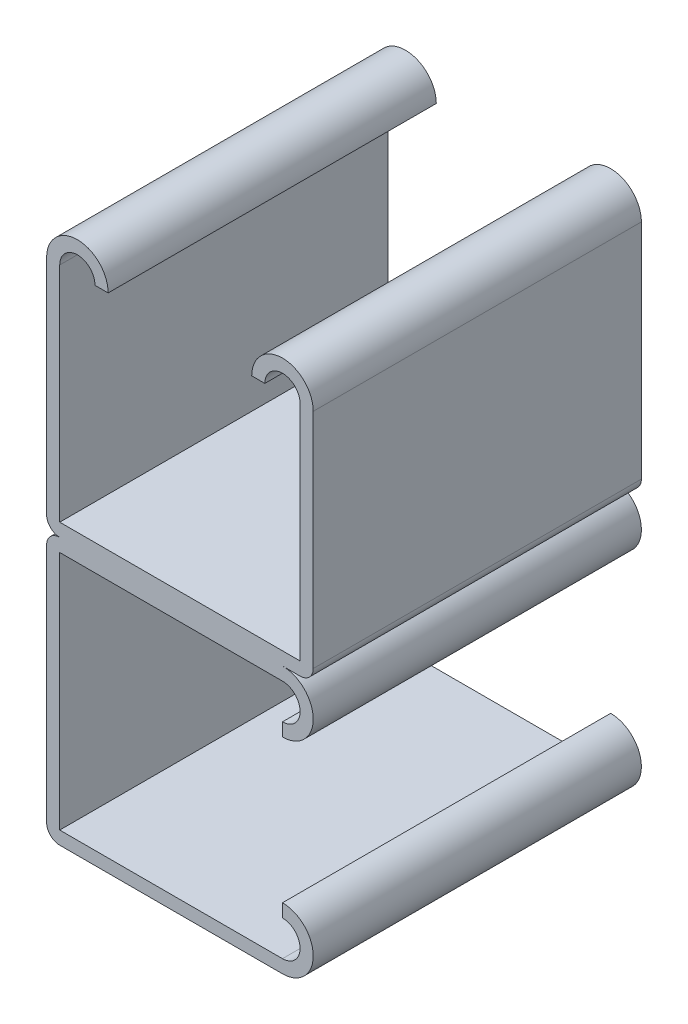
ISO-10303-21;
HEADER;
FILE_DESCRIPTION(('STEP AP214'),'2;1');
FILE_NAME('part.step','',(''),(''),'','','');
FILE_SCHEMA(('AUTOMOTIVE_DESIGN { 1 0 10303 214 1 1 1 1 }'));
ENDSEC;
DATA;
#1=APPLICATION_CONTEXT('core data for automotive mechanical design processes');
#2=APPLICATION_PROTOCOL_DEFINITION('international standard','automotive_design',2000,#1);
#3=PRODUCT_CONTEXT('',#1,'mechanical');
#4=PRODUCT('Part','Part','',(#3));
#5=PRODUCT_RELATED_PRODUCT_CATEGORY('part','',(#4));
#6=PRODUCT_DEFINITION_FORMATION('','',#4);
#7=PRODUCT_DEFINITION_CONTEXT('part definition',#1,'design');
#8=PRODUCT_DEFINITION('design','',#6,#7);
#9=PRODUCT_DEFINITION_SHAPE('','',#8);
#10=(LENGTH_UNIT() NAMED_UNIT(*) SI_UNIT(.MILLI.,.METRE.));
#11=(NAMED_UNIT(*) PLANE_ANGLE_UNIT() SI_UNIT($,.RADIAN.));
#12=(NAMED_UNIT(*) SI_UNIT($,.STERADIAN.) SOLID_ANGLE_UNIT());
#13=UNCERTAINTY_MEASURE_WITH_UNIT(LENGTH_MEASURE(1.E-05),#10,'distance_accuracy_value','');
#14=(GEOMETRIC_REPRESENTATION_CONTEXT(3) GLOBAL_UNCERTAINTY_ASSIGNED_CONTEXT((#13)) GLOBAL_UNIT_ASSIGNED_CONTEXT((#10,
#11,#12)) REPRESENTATION_CONTEXT('',''));
#15=CARTESIAN_POINT('',(0.,0.,0.));
#16=DIRECTION('',(0.,0.,1.));
#17=DIRECTION('',(1.,0.,0.));
#18=AXIS2_PLACEMENT_3D('',#15,#16,#17);
#19=CARTESIAN_POINT('',(1.016,0.,12.7));
#20=DIRECTION('',(0.,1.,0.));
#21=DIRECTION('',(0.,0.,1.));
#22=AXIS2_PLACEMENT_3D('',#19,#20,#21);
#23=PLANE('',#22);
#24=DIRECTION('',(0.,0.,-1.));
#25=VECTOR('',#24,1.);
#26=CARTESIAN_POINT('',(18.25625,1.89923025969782E-13,12.7));
#27=LINE('',#26,#25);
#28=CARTESIAN_POINT('',(18.25625,0.,12.7));
#29=VERTEX_POINT('',#28);
#30=CARTESIAN_POINT('',(18.25625,1.89923025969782E-13,-12.7));
#31=VERTEX_POINT('',#30);
#32=EDGE_CURVE('E198',#29,#31,#27,.T.);
#33=ORIENTED_EDGE('',*,*,#32,.T.);
#34=DIRECTION('',(1.,0.,0.));
#35=VECTOR('',#34,1.);
#36=CARTESIAN_POINT('',(1.016,0.,-12.7));
#37=LINE('',#36,#35);
#38=CARTESIAN_POINT('',(19.6215,0.,-12.7));
#39=VERTEX_POINT('',#38);
#40=EDGE_CURVE('E201',#31,#39,#37,.T.);
#41=ORIENTED_EDGE('',*,*,#40,.T.);
#42=DIRECTION('',(0.,0.,-1.));
#43=VECTOR('',#42,1.);
#44=CARTESIAN_POINT('',(19.6215,0.,12.7));
#45=LINE('',#44,#43);
#46=CARTESIAN_POINT('',(19.6215,0.,12.7));
#47=VERTEX_POINT('',#46);
#48=EDGE_CURVE('E264',#47,#39,#45,.T.);
#49=ORIENTED_EDGE('',*,*,#48,.F.);
#50=DIRECTION('',(1.,0.,0.));
#51=VECTOR('',#50,1.);
#52=CARTESIAN_POINT('',(1.016,0.,12.7));
#53=LINE('',#52,#51);
#54=EDGE_CURVE('E60',#29,#47,#53,.T.);
#55=ORIENTED_EDGE('',*,*,#54,.F.);
#56=EDGE_LOOP('',(#33,#41,#49,#55));
#57=FACE_BOUND('',#56,.T.);
#58=ADVANCED_FACE('F41',(#57),#23,.F.);
#59=CARTESIAN_POINT('',(2.38125,18.25625,12.7));
#60=DIRECTION('',(0.,0.,-1.));
#61=DIRECTION('',(-1.,0.,0.));
#62=AXIS2_PLACEMENT_3D('',#59,#60,#61);
#63=CYLINDRICAL_SURFACE('',#62,2.38125);
#64=CARTESIAN_POINT('',(2.38125,18.25625,-12.7));
#65=DIRECTION('',(0.,0.,1.));
#66=DIRECTION('',(-1.,0.,0.));
#67=AXIS2_PLACEMENT_3D('',#64,#65,#66);
#68=CIRCLE('',#67,2.38125);
#69=CARTESIAN_POINT('',(4.7625,18.25625,-12.7));
#70=VERTEX_POINT('',#69);
#71=CARTESIAN_POINT('',(0.,18.25625,-12.7));
#72=VERTEX_POINT('',#71);
#73=EDGE_CURVE('E195',#70,#72,#68,.T.);
#74=ORIENTED_EDGE('',*,*,#73,.T.);
#75=DIRECTION('',(0.,0.,-1.));
#76=VECTOR('',#75,1.);
#77=CARTESIAN_POINT('',(0.,18.25625,12.7));
#78=LINE('',#77,#76);
#79=CARTESIAN_POINT('',(0.,18.25625,12.7));
#80=VERTEX_POINT('',#79);
#81=EDGE_CURVE('E11',#80,#72,#78,.T.);
#82=ORIENTED_EDGE('',*,*,#81,.F.);
#83=CARTESIAN_POINT('',(2.38125,18.25625,12.7));
#84=DIRECTION('',(0.,0.,1.));
#85=DIRECTION('',(-1.,0.,0.));
#86=AXIS2_PLACEMENT_3D('',#83,#84,#85);
#87=CIRCLE('',#86,2.38125);
#88=CARTESIAN_POINT('',(4.7625,18.25625,12.7));
#89=VERTEX_POINT('',#88);
#90=EDGE_CURVE('E234',#89,#80,#87,.T.);
#91=ORIENTED_EDGE('',*,*,#90,.F.);
#92=DIRECTION('',(0.,0.,-1.));
#93=VECTOR('',#92,1.);
#94=CARTESIAN_POINT('',(4.7625,18.25625,12.7));
#95=LINE('',#94,#93);
#96=EDGE_CURVE('E186',#89,#70,#95,.T.);
#97=ORIENTED_EDGE('',*,*,#96,.T.);
#98=EDGE_LOOP('',(#74,#82,#91,#97));
#99=FACE_BOUND('',#98,.T.);
#100=ADVANCED_FACE('F43',(#99),#63,.T.);
#101=CARTESIAN_POINT('',(0.,18.25625,12.7));
#102=DIRECTION('',(1.,0.,0.));
#103=DIRECTION('',(0.,1.,0.));
#104=AXIS2_PLACEMENT_3D('',#101,#102,#103);
#105=PLANE('',#104);
#106=DIRECTION('',(0.,-1.,0.));
#107=VECTOR('',#106,1.);
#108=CARTESIAN_POINT('',(0.,18.25625,-12.7));
#109=LINE('',#108,#107);
#110=CARTESIAN_POINT('',(0.,1.016,-12.7));
#111=VERTEX_POINT('',#110);
#112=EDGE_CURVE('E200',#72,#111,#109,.T.);
#113=ORIENTED_EDGE('',*,*,#112,.T.);
#114=DIRECTION('',(0.,0.,-1.));
#115=VECTOR('',#114,1.);
#116=CARTESIAN_POINT('',(0.,1.016,12.7));
#117=LINE('',#116,#115);
#118=CARTESIAN_POINT('',(0.,1.016,12.7));
#119=VERTEX_POINT('',#118);
#120=EDGE_CURVE('E49',#119,#111,#117,.T.);
#121=ORIENTED_EDGE('',*,*,#120,.F.);
#122=DIRECTION('',(0.,-1.,0.));
#123=VECTOR('',#122,1.);
#124=CARTESIAN_POINT('',(0.,18.25625,12.7));
#125=LINE('',#124,#123);
#126=EDGE_CURVE('E123',#80,#119,#125,.T.);
#127=ORIENTED_EDGE('',*,*,#126,.F.);
#128=ORIENTED_EDGE('',*,*,#81,.T.);
#129=EDGE_LOOP('',(#113,#121,#127,#128));
#130=FACE_BOUND('',#129,.T.);
#131=ADVANCED_FACE('F638',(#130),#105,.F.);
#132=CARTESIAN_POINT('',(1.016,1.016,12.7));
#133=DIRECTION('',(0.,0.,-1.));
#134=DIRECTION('',(-1.,0.,0.));
#135=AXIS2_PLACEMENT_3D('',#132,#133,#134);
#136=CYLINDRICAL_SURFACE('',#135,1.016);
#137=CARTESIAN_POINT('',(1.016,1.016,-12.7));
#138=DIRECTION('',(0.,0.,1.));
#139=DIRECTION('',(-1.,0.,0.));
#140=AXIS2_PLACEMENT_3D('',#137,#138,#139);
#141=CIRCLE('',#140,1.016);
#142=CARTESIAN_POINT('',(1.016,0.,-12.7));
#143=VERTEX_POINT('',#142);
#144=EDGE_CURVE('E202',#111,#143,#141,.T.);
#145=ORIENTED_EDGE('',*,*,#144,.T.);
#146=DIRECTION('',(0.,0.,-1.));
#147=VECTOR('',#146,1.);
#148=CARTESIAN_POINT('',(1.016,0.,12.7));
#149=LINE('',#148,#147);
#150=CARTESIAN_POINT('',(1.016,0.,12.7));
#151=VERTEX_POINT('',#150);
#152=EDGE_CURVE('E269',#151,#143,#149,.T.);
#153=ORIENTED_EDGE('',*,*,#152,.F.);
#154=CARTESIAN_POINT('',(1.016,1.016,12.7));
#155=DIRECTION('',(0.,0.,1.));
#156=DIRECTION('',(-1.,0.,0.));
#157=AXIS2_PLACEMENT_3D('',#154,#155,#156);
#158=CIRCLE('',#157,1.016);
#159=EDGE_CURVE('E277',#119,#151,#158,.T.);
#160=ORIENTED_EDGE('',*,*,#159,.F.);
#161=ORIENTED_EDGE('',*,*,#120,.T.);
#162=EDGE_LOOP('',(#145,#153,#160,#161));
#163=FACE_BOUND('',#162,.T.);
#164=ADVANCED_FACE('F280',(#163),#136,.T.);
#165=CARTESIAN_POINT('',(19.6215,1.016,12.7));
#166=DIRECTION('',(0.,0.,-1.));
#167=DIRECTION('',(-1.,0.,0.));
#168=AXIS2_PLACEMENT_3D('',#165,#166,#167);
#169=CYLINDRICAL_SURFACE('',#168,1.016);
#170=CARTESIAN_POINT('',(19.6215,1.016,-12.7));
#171=DIRECTION('',(0.,0.,1.));
#172=DIRECTION('',(1.,0.,0.));
#173=AXIS2_PLACEMENT_3D('',#170,#171,#172);
#174=CIRCLE('',#173,1.016);
#175=CARTESIAN_POINT('',(20.6375,1.016,-12.7));
#176=VERTEX_POINT('',#175);
#177=EDGE_CURVE('E210',#39,#176,#174,.T.);
#178=ORIENTED_EDGE('',*,*,#177,.T.);
#179=DIRECTION('',(0.,0.,-1.));
#180=VECTOR('',#179,1.);
#181=CARTESIAN_POINT('',(20.6375,1.016,12.7));
#182=LINE('',#181,#180);
#183=CARTESIAN_POINT('',(20.6375,1.016,12.7));
#184=VERTEX_POINT('',#183);
#185=EDGE_CURVE('E257',#184,#176,#182,.T.);
#186=ORIENTED_EDGE('',*,*,#185,.F.);
#187=CARTESIAN_POINT('',(19.6215,1.016,12.7));
#188=DIRECTION('',(0.,0.,1.));
#189=DIRECTION('',(1.,0.,0.));
#190=AXIS2_PLACEMENT_3D('',#187,#188,#189);
#191=CIRCLE('',#190,1.016);
#192=EDGE_CURVE('E404',#47,#184,#191,.T.);
#193=ORIENTED_EDGE('',*,*,#192,.F.);
#194=ORIENTED_EDGE('',*,*,#48,.T.);
#195=EDGE_LOOP('',(#178,#186,#193,#194));
#196=FACE_BOUND('',#195,.T.);
#197=ADVANCED_FACE('F645',(#196),#169,.T.);
#198=CARTESIAN_POINT('',(20.6375,1.016,12.7));
#199=DIRECTION('',(-1.,0.,0.));
#200=DIRECTION('',(0.,-1.,0.));
#201=AXIS2_PLACEMENT_3D('',#198,#199,#200);
#202=PLANE('',#201);
#203=DIRECTION('',(0.,1.,0.));
#204=VECTOR('',#203,1.);
#205=CARTESIAN_POINT('',(20.6375,1.016,-12.7));
#206=LINE('',#205,#204);
#207=CARTESIAN_POINT('',(20.6375,18.25625,-12.7));
#208=VERTEX_POINT('',#207);
#209=EDGE_CURVE('E208',#176,#208,#206,.T.);
#210=ORIENTED_EDGE('',*,*,#209,.T.);
#211=DIRECTION('',(0.,0.,-1.));
#212=VECTOR('',#211,1.);
#213=CARTESIAN_POINT('',(20.6375,18.25625,12.7));
#214=LINE('',#213,#212);
#215=CARTESIAN_POINT('',(20.6375,18.25625,12.7));
#216=VERTEX_POINT('',#215);
#217=EDGE_CURVE('E259',#216,#208,#214,.T.);
#218=ORIENTED_EDGE('',*,*,#217,.F.);
#219=DIRECTION('',(0.,1.,0.));
#220=VECTOR('',#219,1.);
#221=CARTESIAN_POINT('',(20.6375,1.016,12.7));
#222=LINE('',#221,#220);
#223=EDGE_CURVE('E406',#184,#216,#222,.T.);
#224=ORIENTED_EDGE('',*,*,#223,.F.);
#225=ORIENTED_EDGE('',*,*,#185,.T.);
#226=EDGE_LOOP('',(#210,#218,#224,#225));
#227=FACE_BOUND('',#226,.T.);
#228=ADVANCED_FACE('F660',(#227),#202,.F.);
#229=CARTESIAN_POINT('',(18.25625,18.25625,12.7));
#230=DIRECTION('',(0.,0.,-1.));
#231=DIRECTION('',(-1.,0.,0.));
#232=AXIS2_PLACEMENT_3D('',#229,#230,#231);
#233=CYLINDRICAL_SURFACE('',#232,2.38125);
#234=CARTESIAN_POINT('',(18.25625,18.25625,-12.7));
#235=DIRECTION('',(0.,0.,1.));
#236=DIRECTION('',(1.,0.,0.));
#237=AXIS2_PLACEMENT_3D('',#234,#235,#236);
#238=CIRCLE('',#237,2.38125);
#239=CARTESIAN_POINT('',(15.875,18.25625,-12.7));
#240=VERTEX_POINT('',#239);
#241=EDGE_CURVE('E215',#208,#240,#238,.T.);
#242=ORIENTED_EDGE('',*,*,#241,.T.);
#243=DIRECTION('',(0.,0.,-1.));
#244=VECTOR('',#243,1.);
#245=CARTESIAN_POINT('',(15.875,18.25625,12.7));
#246=LINE('',#245,#244);
#247=CARTESIAN_POINT('',(15.875,18.25625,12.7));
#248=VERTEX_POINT('',#247);
#249=EDGE_CURVE('E255',#248,#240,#246,.T.);
#250=ORIENTED_EDGE('',*,*,#249,.F.);
#251=CARTESIAN_POINT('',(18.25625,18.25625,12.7));
#252=DIRECTION('',(0.,0.,1.));
#253=DIRECTION('',(1.,0.,0.));
#254=AXIS2_PLACEMENT_3D('',#251,#252,#253);
#255=CIRCLE('',#254,2.38125);
#256=EDGE_CURVE('E407',#216,#248,#255,.T.);
#257=ORIENTED_EDGE('',*,*,#256,.F.);
#258=ORIENTED_EDGE('',*,*,#217,.T.);
#259=EDGE_LOOP('',(#242,#250,#257,#258));
#260=FACE_BOUND('',#259,.T.);
#261=ADVANCED_FACE('F663',(#260),#233,.T.);
#262=CARTESIAN_POINT('',(16.891,18.25625,12.7));
#263=DIRECTION('',(0.,1.,0.));
#264=DIRECTION('',(0.,0.,1.));
#265=AXIS2_PLACEMENT_3D('',#262,#263,#264);
#266=PLANE('',#265);
#267=DIRECTION('',(1.,0.,0.));
#268=VECTOR('',#267,1.);
#269=CARTESIAN_POINT('',(16.891,18.25625,-12.7));
#270=LINE('',#269,#268);
#271=CARTESIAN_POINT('',(16.891,18.25625,-12.7));
#272=VERTEX_POINT('',#271);
#273=EDGE_CURVE('E217',#240,#272,#270,.T.);
#274=ORIENTED_EDGE('',*,*,#273,.T.);
#275=DIRECTION('',(0.,0.,-1.));
#276=VECTOR('',#275,1.);
#277=CARTESIAN_POINT('',(16.891,18.25625,12.7));
#278=LINE('',#277,#276);
#279=CARTESIAN_POINT('',(16.891,18.25625,12.7));
#280=VERTEX_POINT('',#279);
#281=EDGE_CURVE('E247',#280,#272,#278,.T.);
#282=ORIENTED_EDGE('',*,*,#281,.F.);
#283=DIRECTION('',(1.,0.,0.));
#284=VECTOR('',#283,1.);
#285=CARTESIAN_POINT('',(16.891,18.25625,12.7));
#286=LINE('',#285,#284);
#287=EDGE_CURVE('E413',#248,#280,#286,.T.);
#288=ORIENTED_EDGE('',*,*,#287,.F.);
#289=ORIENTED_EDGE('',*,*,#249,.T.);
#290=EDGE_LOOP('',(#274,#282,#288,#289));
#291=FACE_BOUND('',#290,.T.);
#292=ADVANCED_FACE('F673',(#291),#266,.F.);
#293=CARTESIAN_POINT('',(18.25625,18.25625,12.7));
#294=DIRECTION('',(0.,0.,-1.));
#295=DIRECTION('',(-1.,0.,0.));
#296=AXIS2_PLACEMENT_3D('',#293,#294,#295);
#297=CYLINDRICAL_SURFACE('',#296,1.36525);
#298=CARTESIAN_POINT('',(18.25625,18.25625,-12.7));
#299=DIRECTION('',(0.,0.,-1.));
#300=DIRECTION('',(1.,0.,0.));
#301=AXIS2_PLACEMENT_3D('',#298,#299,#300);
#302=CIRCLE('',#301,1.36525);
#303=CARTESIAN_POINT('',(19.6215,18.25625,-12.7));
#304=VERTEX_POINT('',#303);
#305=EDGE_CURVE('E219',#272,#304,#302,.T.);
#306=ORIENTED_EDGE('',*,*,#305,.T.);
#307=DIRECTION('',(0.,0.,-1.));
#308=VECTOR('',#307,1.);
#309=CARTESIAN_POINT('',(19.6215,18.25625,12.7));
#310=LINE('',#309,#308);
#311=CARTESIAN_POINT('',(19.6215,18.25625,12.7));
#312=VERTEX_POINT('',#311);
#313=EDGE_CURVE('E242',#312,#304,#310,.T.);
#314=ORIENTED_EDGE('',*,*,#313,.F.);
#315=CARTESIAN_POINT('',(18.25625,18.25625,12.7));
#316=DIRECTION('',(0.,0.,-1.));
#317=DIRECTION('',(1.,0.,0.));
#318=AXIS2_PLACEMENT_3D('',#315,#316,#317);
#319=CIRCLE('',#318,1.36525);
#320=EDGE_CURVE('E417',#280,#312,#319,.T.);
#321=ORIENTED_EDGE('',*,*,#320,.F.);
#322=ORIENTED_EDGE('',*,*,#281,.T.);
#323=EDGE_LOOP('',(#306,#314,#321,#322));
#324=FACE_BOUND('',#323,.T.);
#325=ADVANCED_FACE('F682',(#324),#297,.F.);
#326=CARTESIAN_POINT('',(19.6215,1.016,12.7));
#327=DIRECTION('',(1.,0.,0.));
#328=DIRECTION('',(0.,1.,0.));
#329=AXIS2_PLACEMENT_3D('',#326,#327,#328);
#330=PLANE('',#329);
#331=DIRECTION('',(0.,-1.,0.));
#332=VECTOR('',#331,1.);
#333=CARTESIAN_POINT('',(19.6215,1.016,-12.7));
#334=LINE('',#333,#332);
#335=CARTESIAN_POINT('',(19.6215,1.016,-12.7));
#336=VERTEX_POINT('',#335);
#337=EDGE_CURVE('E225',#304,#336,#334,.T.);
#338=ORIENTED_EDGE('',*,*,#337,.T.);
#339=DIRECTION('',(0.,0.,-1.));
#340=VECTOR('',#339,1.);
#341=CARTESIAN_POINT('',(19.6215,1.016,12.7));
#342=LINE('',#341,#340);
#343=CARTESIAN_POINT('',(19.6215,1.016,12.7));
#344=VERTEX_POINT('',#343);
#345=EDGE_CURVE('E239',#344,#336,#342,.T.);
#346=ORIENTED_EDGE('',*,*,#345,.F.);
#347=DIRECTION('',(0.,-1.,0.));
#348=VECTOR('',#347,1.);
#349=CARTESIAN_POINT('',(19.6215,1.016,12.7));
#350=LINE('',#349,#348);
#351=EDGE_CURVE('E416',#312,#344,#350,.T.);
#352=ORIENTED_EDGE('',*,*,#351,.F.);
#353=ORIENTED_EDGE('',*,*,#313,.T.);
#354=EDGE_LOOP('',(#338,#346,#352,#353));
#355=FACE_BOUND('',#354,.T.);
#356=ADVANCED_FACE('F458',(#355),#330,.F.);
#357=CARTESIAN_POINT('',(1.016,1.016,12.7));
#358=DIRECTION('',(0.,-1.,0.));
#359=DIRECTION('',(1.,0.,0.));
#360=AXIS2_PLACEMENT_3D('',#357,#358,#359);
#361=PLANE('',#360);
#362=DIRECTION('',(-1.,0.,0.));
#363=VECTOR('',#362,1.);
#364=CARTESIAN_POINT('',(1.016,1.016,-12.7));
#365=LINE('',#364,#363);
#366=CARTESIAN_POINT('',(1.016,1.016,-12.7));
#367=VERTEX_POINT('',#366);
#368=EDGE_CURVE('E223',#336,#367,#365,.T.);
#369=ORIENTED_EDGE('',*,*,#368,.T.);
#370=DIRECTION('',(0.,0.,-1.));
#371=VECTOR('',#370,1.);
#372=CARTESIAN_POINT('',(1.016,1.016,12.7));
#373=LINE('',#372,#371);
#374=CARTESIAN_POINT('',(1.016,1.016,12.7));
#375=VERTEX_POINT('',#374);
#376=EDGE_CURVE('E177',#375,#367,#373,.T.);
#377=ORIENTED_EDGE('',*,*,#376,.F.);
#378=DIRECTION('',(-1.,0.,0.));
#379=VECTOR('',#378,1.);
#380=CARTESIAN_POINT('',(1.016,1.016,12.7));
#381=LINE('',#380,#379);
#382=EDGE_CURVE('E164',#344,#375,#381,.T.);
#383=ORIENTED_EDGE('',*,*,#382,.F.);
#384=ORIENTED_EDGE('',*,*,#345,.T.);
#385=EDGE_LOOP('',(#369,#377,#383,#384));
#386=FACE_BOUND('',#385,.T.);
#387=ADVANCED_FACE('F465',(#386),#361,.F.);
#388=CARTESIAN_POINT('',(1.016,18.25625,12.7));
#389=DIRECTION('',(-1.,0.,0.));
#390=DIRECTION('',(0.,-1.,0.));
#391=AXIS2_PLACEMENT_3D('',#388,#389,#390);
#392=PLANE('',#391);
#393=DIRECTION('',(0.,1.,0.));
#394=VECTOR('',#393,1.);
#395=CARTESIAN_POINT('',(1.016,18.25625,-12.7));
#396=LINE('',#395,#394);
#397=CARTESIAN_POINT('',(1.016,18.25625,-12.7));
#398=VERTEX_POINT('',#397);
#399=EDGE_CURVE('E174',#367,#398,#396,.T.);
#400=ORIENTED_EDGE('',*,*,#399,.T.);
#401=DIRECTION('',(0.,0.,-1.));
#402=VECTOR('',#401,1.);
#403=CARTESIAN_POINT('',(1.016,18.25625,12.7));
#404=LINE('',#403,#402);
#405=CARTESIAN_POINT('',(1.016,18.25625,12.7));
#406=VERTEX_POINT('',#405);
#407=EDGE_CURVE('E175',#406,#398,#404,.T.);
#408=ORIENTED_EDGE('',*,*,#407,.F.);
#409=DIRECTION('',(0.,1.,0.));
#410=VECTOR('',#409,1.);
#411=CARTESIAN_POINT('',(1.016,18.25625,12.7));
#412=LINE('',#411,#410);
#413=EDGE_CURVE('E159',#375,#406,#412,.T.);
#414=ORIENTED_EDGE('',*,*,#413,.F.);
#415=ORIENTED_EDGE('',*,*,#376,.T.);
#416=EDGE_LOOP('',(#400,#408,#414,#415));
#417=FACE_BOUND('',#416,.T.);
#418=ADVANCED_FACE('F173',(#417),#392,.F.);
#419=CARTESIAN_POINT('',(2.38125,18.25625,12.7));
#420=DIRECTION('',(0.,0.,-1.));
#421=DIRECTION('',(-1.,0.,0.));
#422=AXIS2_PLACEMENT_3D('',#419,#420,#421);
#423=CYLINDRICAL_SURFACE('',#422,1.36525);
#424=CARTESIAN_POINT('',(2.38125,18.25625,-12.7));
#425=DIRECTION('',(0.,0.,-1.));
#426=DIRECTION('',(-1.,0.,0.));
#427=AXIS2_PLACEMENT_3D('',#424,#425,#426);
#428=CIRCLE('',#427,1.36525);
#429=CARTESIAN_POINT('',(3.7465,18.25625,-12.7));
#430=VERTEX_POINT('',#429);
#431=EDGE_CURVE('E229',#398,#430,#428,.T.);
#432=ORIENTED_EDGE('',*,*,#431,.T.);
#433=DIRECTION('',(0.,0.,-1.));
#434=VECTOR('',#433,1.);
#435=CARTESIAN_POINT('',(3.7465,18.25625,12.7));
#436=LINE('',#435,#434);
#437=CARTESIAN_POINT('',(3.7465,18.25625,12.7));
#438=VERTEX_POINT('',#437);
#439=EDGE_CURVE('E179',#438,#430,#436,.T.);
#440=ORIENTED_EDGE('',*,*,#439,.F.);
#441=CARTESIAN_POINT('',(2.38125,18.25625,12.7));
#442=DIRECTION('',(0.,0.,-1.));
#443=DIRECTION('',(-1.,0.,0.));
#444=AXIS2_PLACEMENT_3D('',#441,#442,#443);
#445=CIRCLE('',#444,1.36525);
#446=EDGE_CURVE('E162',#406,#438,#445,.T.);
#447=ORIENTED_EDGE('',*,*,#446,.F.);
#448=ORIENTED_EDGE('',*,*,#407,.T.);
#449=EDGE_LOOP('',(#432,#440,#447,#448));
#450=FACE_BOUND('',#449,.T.);
#451=ADVANCED_FACE('F185',(#450),#423,.F.);
#452=CARTESIAN_POINT('',(4.7625,18.25625,12.7));
#453=DIRECTION('',(0.,1.,0.));
#454=DIRECTION('',(0.,0.,1.));
#455=AXIS2_PLACEMENT_3D('',#452,#453,#454);
#456=PLANE('',#455);
#457=DIRECTION('',(1.,0.,0.));
#458=VECTOR('',#457,1.);
#459=CARTESIAN_POINT('',(4.7625,18.25625,-12.7));
#460=LINE('',#459,#458);
#461=EDGE_CURVE('E120',#430,#70,#460,.T.);
#462=ORIENTED_EDGE('',*,*,#461,.T.);
#463=ORIENTED_EDGE('',*,*,#96,.F.);
#464=DIRECTION('',(1.,0.,0.));
#465=VECTOR('',#464,1.);
#466=CARTESIAN_POINT('',(4.7625,18.25625,12.7));
#467=LINE('',#466,#465);
#468=EDGE_CURVE('E67',#438,#89,#467,.T.);
#469=ORIENTED_EDGE('',*,*,#468,.F.);
#470=ORIENTED_EDGE('',*,*,#439,.T.);
#471=EDGE_LOOP('',(#462,#463,#469,#470));
#472=FACE_BOUND('',#471,.T.);
#473=ADVANCED_FACE('F464',(#472),#456,.F.);
#474=CARTESIAN_POINT('',(2.38125,18.25625,12.7));
#475=DIRECTION('',(0.,0.,-1.));
#476=DIRECTION('',(-1.,0.,0.));
#477=AXIS2_PLACEMENT_3D('',#474,#475,#476);
#478=PLANE('',#477);
#479=ORIENTED_EDGE('',*,*,#90,.T.);
#480=ORIENTED_EDGE('',*,*,#126,.T.);
#481=ORIENTED_EDGE('',*,*,#159,.T.);
#482=CARTESIAN_POINT('',(1.01600000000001,-1.01599999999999,12.7));
#483=DIRECTION('',(0.,0.,1.));
#484=DIRECTION('',(0.,1.,0.));
#485=AXIS2_PLACEMENT_3D('',#482,#483,#484);
#486=CIRCLE('',#485,1.016);
#487=CARTESIAN_POINT('',(0.,-1.016,12.7));
#488=VERTEX_POINT('',#487);
#489=EDGE_CURVE('E474',#151,#488,#486,.T.);
#490=ORIENTED_EDGE('',*,*,#489,.T.);
#491=DIRECTION('',(0.,-1.,0.));
#492=VECTOR('',#491,1.);
#493=CARTESIAN_POINT('',(0.,-1.016,12.7));
#494=LINE('',#493,#492);
#495=CARTESIAN_POINT('',(2.05524303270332E-13,-19.6215,12.7));
#496=VERTEX_POINT('',#495);
#497=EDGE_CURVE('E472',#488,#496,#494,.T.);
#498=ORIENTED_EDGE('',*,*,#497,.T.);
#499=CARTESIAN_POINT('',(1.01600000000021,-19.6215,12.7));
#500=DIRECTION('',(0.,0.,1.));
#501=DIRECTION('',(0.,-1.,0.));
#502=AXIS2_PLACEMENT_3D('',#499,#500,#501);
#503=CIRCLE('',#502,1.016);
#504=CARTESIAN_POINT('',(1.01600000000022,-20.6375,12.7));
#505=VERTEX_POINT('',#504);
#506=EDGE_CURVE('E479',#496,#505,#503,.T.);
#507=ORIENTED_EDGE('',*,*,#506,.T.);
#508=DIRECTION('',(1.,0.,0.));
#509=VECTOR('',#508,1.);
#510=CARTESIAN_POINT('',(1.01600000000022,-20.6375,12.7));
#511=LINE('',#510,#509);
#512=CARTESIAN_POINT('',(18.2562500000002,-20.6374999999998,12.7));
#513=VERTEX_POINT('',#512);
#514=EDGE_CURVE('E487',#505,#513,#511,.T.);
#515=ORIENTED_EDGE('',*,*,#514,.T.);
#516=CARTESIAN_POINT('',(18.2562500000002,-18.2562499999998,12.7));
#517=DIRECTION('',(0.,0.,1.));
#518=DIRECTION('',(0.,-1.,0.));
#519=AXIS2_PLACEMENT_3D('',#516,#517,#518);
#520=CIRCLE('',#519,2.38125);
#521=CARTESIAN_POINT('',(18.2562500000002,-15.8749999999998,12.7));
#522=VERTEX_POINT('',#521);
#523=EDGE_CURVE('E493',#513,#522,#520,.T.);
#524=ORIENTED_EDGE('',*,*,#523,.T.);
#525=DIRECTION('',(0.,-1.,0.));
#526=VECTOR('',#525,1.);
#527=CARTESIAN_POINT('',(18.2562500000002,-16.8909999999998,12.7));
#528=LINE('',#527,#526);
#529=CARTESIAN_POINT('',(18.2562500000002,-16.8909999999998,12.7));
#530=VERTEX_POINT('',#529);
#531=EDGE_CURVE('E492',#522,#530,#528,.T.);
#532=ORIENTED_EDGE('',*,*,#531,.T.);
#533=CARTESIAN_POINT('',(18.2562500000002,-18.2562499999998,12.7));
#534=DIRECTION('',(0.,0.,-1.));
#535=DIRECTION('',(0.,-1.,0.));
#536=AXIS2_PLACEMENT_3D('',#533,#534,#535);
#537=CIRCLE('',#536,1.36525);
#538=CARTESIAN_POINT('',(18.2562500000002,-19.6214999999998,12.7));
#539=VERTEX_POINT('',#538);
#540=EDGE_CURVE('E497',#530,#539,#537,.T.);
#541=ORIENTED_EDGE('',*,*,#540,.T.);
#542=DIRECTION('',(-1.,0.,0.));
#543=VECTOR('',#542,1.);
#544=CARTESIAN_POINT('',(1.01600000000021,-19.6215,12.7));
#545=LINE('',#544,#543);
#546=CARTESIAN_POINT('',(1.01600000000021,-19.6215,12.7));
#547=VERTEX_POINT('',#546);
#548=EDGE_CURVE('E503',#539,#547,#545,.T.);
#549=ORIENTED_EDGE('',*,*,#548,.T.);
#550=DIRECTION('',(0.,1.,0.));
#551=VECTOR('',#550,1.);
#552=CARTESIAN_POINT('',(1.01600000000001,-1.01599999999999,12.7));
#553=LINE('',#552,#551);
#554=CARTESIAN_POINT('',(1.01600000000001,-1.01599999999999,12.7));
#555=VERTEX_POINT('',#554);
#556=EDGE_CURVE('E510',#547,#555,#553,.T.);
#557=ORIENTED_EDGE('',*,*,#556,.T.);
#558=DIRECTION('',(1.,0.,0.));
#559=VECTOR('',#558,1.);
#560=CARTESIAN_POINT('',(18.25625,-1.01599999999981,12.7));
#561=LINE('',#560,#559);
#562=CARTESIAN_POINT('',(18.25625,-1.01599999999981,12.7));
#563=VERTEX_POINT('',#562);
#564=EDGE_CURVE('E512',#555,#563,#561,.T.);
#565=ORIENTED_EDGE('',*,*,#564,.T.);
#566=CARTESIAN_POINT('',(18.25625,-2.38124999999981,12.7));
#567=DIRECTION('',(0.,0.,-1.));
#568=DIRECTION('',(0.,1.,0.));
#569=AXIS2_PLACEMENT_3D('',#566,#567,#568);
#570=CIRCLE('',#569,1.36525);
#571=CARTESIAN_POINT('',(18.25625,-3.74649999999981,12.7));
#572=VERTEX_POINT('',#571);
#573=EDGE_CURVE('E513',#563,#572,#570,.T.);
#574=ORIENTED_EDGE('',*,*,#573,.T.);
#575=DIRECTION('',(0.,-1.,0.));
#576=VECTOR('',#575,1.);
#577=CARTESIAN_POINT('',(18.2562500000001,-4.76249999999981,12.7));
#578=LINE('',#577,#576);
#579=CARTESIAN_POINT('',(18.2562500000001,-4.76249999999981,12.7));
#580=VERTEX_POINT('',#579);
#581=EDGE_CURVE('E354',#572,#580,#578,.T.);
#582=ORIENTED_EDGE('',*,*,#581,.T.);
#583=CARTESIAN_POINT('',(18.25625,-2.38124999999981,12.7));
#584=DIRECTION('',(0.,0.,1.));
#585=DIRECTION('',(0.,1.,0.));
#586=AXIS2_PLACEMENT_3D('',#583,#584,#585);
#587=CIRCLE('',#586,2.38125);
#588=EDGE_CURVE('E350',#580,#29,#587,.T.);
#589=ORIENTED_EDGE('',*,*,#588,.T.);
#590=ORIENTED_EDGE('',*,*,#54,.T.);
#591=ORIENTED_EDGE('',*,*,#192,.T.);
#592=ORIENTED_EDGE('',*,*,#223,.T.);
#593=ORIENTED_EDGE('',*,*,#256,.T.);
#594=ORIENTED_EDGE('',*,*,#287,.T.);
#595=ORIENTED_EDGE('',*,*,#320,.T.);
#596=ORIENTED_EDGE('',*,*,#351,.T.);
#597=ORIENTED_EDGE('',*,*,#382,.T.);
#598=ORIENTED_EDGE('',*,*,#413,.T.);
#599=ORIENTED_EDGE('',*,*,#446,.T.);
#600=ORIENTED_EDGE('',*,*,#468,.T.);
#601=EDGE_LOOP('',(#479,#480,#481,#490,#498,#507,#515,#524,#532,#541,#549,#557,#565,#574,#582,
#589,#590,#591,#592,#593,#594,#595,#596,#597,#598,#599,#600));
#602=FACE_BOUND('',#601,.T.);
#603=ADVANCED_FACE('F158',(#602),#478,.F.);
#604=CARTESIAN_POINT('',(2.38125,18.25625,-12.7));
#605=DIRECTION('',(0.,0.,-1.));
#606=DIRECTION('',(-1.,0.,0.));
#607=AXIS2_PLACEMENT_3D('',#604,#605,#606);
#608=PLANE('',#607);
#609=ORIENTED_EDGE('',*,*,#73,.F.);
#610=ORIENTED_EDGE('',*,*,#461,.F.);
#611=ORIENTED_EDGE('',*,*,#431,.F.);
#612=ORIENTED_EDGE('',*,*,#399,.F.);
#613=ORIENTED_EDGE('',*,*,#368,.F.);
#614=ORIENTED_EDGE('',*,*,#337,.F.);
#615=ORIENTED_EDGE('',*,*,#305,.F.);
#616=ORIENTED_EDGE('',*,*,#273,.F.);
#617=ORIENTED_EDGE('',*,*,#241,.F.);
#618=ORIENTED_EDGE('',*,*,#209,.F.);
#619=ORIENTED_EDGE('',*,*,#177,.F.);
#620=ORIENTED_EDGE('',*,*,#40,.F.);
#621=CARTESIAN_POINT('',(18.25625,-2.38124999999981,-12.7));
#622=DIRECTION('',(0.,0.,1.));
#623=DIRECTION('',(0.,1.,0.));
#624=AXIS2_PLACEMENT_3D('',#621,#622,#623);
#625=CIRCLE('',#624,2.38125);
#626=CARTESIAN_POINT('',(18.2562500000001,-4.76249999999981,-12.7));
#627=VERTEX_POINT('',#626);
#628=EDGE_CURVE('E298',#627,#31,#625,.T.);
#629=ORIENTED_EDGE('',*,*,#628,.F.);
#630=DIRECTION('',(0.,-1.,0.));
#631=VECTOR('',#630,1.);
#632=CARTESIAN_POINT('',(18.2562500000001,-4.76249999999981,-12.7));
#633=LINE('',#632,#631);
#634=CARTESIAN_POINT('',(18.25625,-3.74649999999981,-12.7));
#635=VERTEX_POINT('',#634);
#636=EDGE_CURVE('E345',#635,#627,#633,.T.);
#637=ORIENTED_EDGE('',*,*,#636,.F.);
#638=CARTESIAN_POINT('',(18.25625,-2.38124999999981,-12.7));
#639=DIRECTION('',(0.,0.,-1.));
#640=DIRECTION('',(0.,1.,0.));
#641=AXIS2_PLACEMENT_3D('',#638,#639,#640);
#642=CIRCLE('',#641,1.36525);
#643=CARTESIAN_POINT('',(18.25625,-1.01599999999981,-12.7));
#644=VERTEX_POINT('',#643);
#645=EDGE_CURVE('E339',#644,#635,#642,.T.);
#646=ORIENTED_EDGE('',*,*,#645,.F.);
#647=DIRECTION('',(1.,0.,0.));
#648=VECTOR('',#647,1.);
#649=CARTESIAN_POINT('',(18.25625,-1.01599999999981,-12.7));
#650=LINE('',#649,#648);
#651=CARTESIAN_POINT('',(1.01600000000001,-1.01599999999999,-12.7));
#652=VERTEX_POINT('',#651);
#653=EDGE_CURVE('E333',#652,#644,#650,.T.);
#654=ORIENTED_EDGE('',*,*,#653,.F.);
#655=DIRECTION('',(0.,1.,0.));
#656=VECTOR('',#655,1.);
#657=CARTESIAN_POINT('',(1.01600000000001,-1.01599999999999,-12.7));
#658=LINE('',#657,#656);
#659=CARTESIAN_POINT('',(1.01600000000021,-19.6215,-12.7));
#660=VERTEX_POINT('',#659);
#661=EDGE_CURVE('E332',#660,#652,#658,.T.);
#662=ORIENTED_EDGE('',*,*,#661,.F.);
#663=DIRECTION('',(-1.,0.,0.));
#664=VECTOR('',#663,1.);
#665=CARTESIAN_POINT('',(1.01600000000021,-19.6215,-12.7));
#666=LINE('',#665,#664);
#667=CARTESIAN_POINT('',(18.2562500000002,-19.6214999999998,-12.7));
#668=VERTEX_POINT('',#667);
#669=EDGE_CURVE('E330',#668,#660,#666,.T.);
#670=ORIENTED_EDGE('',*,*,#669,.F.);
#671=CARTESIAN_POINT('',(18.2562500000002,-18.2562499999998,-12.7));
#672=DIRECTION('',(0.,0.,-1.));
#673=DIRECTION('',(0.,-1.,0.));
#674=AXIS2_PLACEMENT_3D('',#671,#672,#673);
#675=CIRCLE('',#674,1.36525);
#676=CARTESIAN_POINT('',(18.2562500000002,-16.8909999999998,-12.7));
#677=VERTEX_POINT('',#676);
#678=EDGE_CURVE('E325',#677,#668,#675,.T.);
#679=ORIENTED_EDGE('',*,*,#678,.F.);
#680=DIRECTION('',(0.,-1.,0.));
#681=VECTOR('',#680,1.);
#682=CARTESIAN_POINT('',(18.2562500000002,-16.8909999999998,-12.7));
#683=LINE('',#682,#681);
#684=CARTESIAN_POINT('',(18.2562500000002,-15.8749999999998,-12.7));
#685=VERTEX_POINT('',#684);
#686=EDGE_CURVE('E316',#685,#677,#683,.T.);
#687=ORIENTED_EDGE('',*,*,#686,.F.);
#688=CARTESIAN_POINT('',(18.2562500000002,-18.2562499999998,-12.7));
#689=DIRECTION('',(0.,0.,1.));
#690=DIRECTION('',(0.,-1.,0.));
#691=AXIS2_PLACEMENT_3D('',#688,#689,#690);
#692=CIRCLE('',#691,2.38125);
#693=CARTESIAN_POINT('',(18.2562500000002,-20.6374999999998,-12.7));
#694=VERTEX_POINT('',#693);
#695=EDGE_CURVE('E314',#694,#685,#692,.T.);
#696=ORIENTED_EDGE('',*,*,#695,.F.);
#697=DIRECTION('',(1.,0.,0.));
#698=VECTOR('',#697,1.);
#699=CARTESIAN_POINT('',(1.01600000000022,-20.6375,-12.7));
#700=LINE('',#699,#698);
#701=CARTESIAN_POINT('',(1.01600000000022,-20.6375,-12.7));
#702=VERTEX_POINT('',#701);
#703=EDGE_CURVE('E311',#702,#694,#700,.T.);
#704=ORIENTED_EDGE('',*,*,#703,.F.);
#705=CARTESIAN_POINT('',(1.01600000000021,-19.6215,-12.7));
#706=DIRECTION('',(0.,0.,1.));
#707=DIRECTION('',(0.,-1.,0.));
#708=AXIS2_PLACEMENT_3D('',#705,#706,#707);
#709=CIRCLE('',#708,1.016);
#710=CARTESIAN_POINT('',(2.05524303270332E-13,-19.6215,-12.7));
#711=VERTEX_POINT('',#710);
#712=EDGE_CURVE('E301',#711,#702,#709,.T.);
#713=ORIENTED_EDGE('',*,*,#712,.F.);
#714=DIRECTION('',(0.,-1.,0.));
#715=VECTOR('',#714,1.);
#716=CARTESIAN_POINT('',(0.,-1.016,-12.7));
#717=LINE('',#716,#715);
#718=CARTESIAN_POINT('',(0.,-1.016,-12.7));
#719=VERTEX_POINT('',#718);
#720=EDGE_CURVE('E293',#719,#711,#717,.T.);
#721=ORIENTED_EDGE('',*,*,#720,.F.);
#722=CARTESIAN_POINT('',(1.01600000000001,-1.01599999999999,-12.7));
#723=DIRECTION('',(0.,0.,1.));
#724=DIRECTION('',(0.,1.,0.));
#725=AXIS2_PLACEMENT_3D('',#722,#723,#724);
#726=CIRCLE('',#725,1.016);
#727=EDGE_CURVE('E290',#143,#719,#726,.T.);
#728=ORIENTED_EDGE('',*,*,#727,.F.);
#729=ORIENTED_EDGE('',*,*,#144,.F.);
#730=ORIENTED_EDGE('',*,*,#112,.F.);
#731=EDGE_LOOP('',(#609,#610,#611,#612,#613,#614,#615,#616,#617,#618,#619,#620,#629,#637,#646,
#654,#662,#670,#679,#687,#696,#704,#713,#721,#728,#729,#730));
#732=FACE_BOUND('',#731,.T.);
#733=ADVANCED_FACE('F284',(#732),#608,.T.);
#734=CARTESIAN_POINT('',(18.25625,-2.38124999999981,12.7));
#735=DIRECTION('',(0.,0.,-1.));
#736=DIRECTION('',(-1.,0.,0.));
#737=AXIS2_PLACEMENT_3D('',#734,#735,#736);
#738=CYLINDRICAL_SURFACE('',#737,2.38125);
#739=ORIENTED_EDGE('',*,*,#628,.T.);
#740=ORIENTED_EDGE('',*,*,#32,.F.);
#741=ORIENTED_EDGE('',*,*,#588,.F.);
#742=DIRECTION('',(0.,0.,-1.));
#743=VECTOR('',#742,1.);
#744=CARTESIAN_POINT('',(18.2562500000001,-4.76249999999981,12.7));
#745=LINE('',#744,#743);
#746=EDGE_CURVE('E348',#580,#627,#745,.T.);
#747=ORIENTED_EDGE('',*,*,#746,.T.);
#748=EDGE_LOOP('',(#739,#740,#741,#747));
#749=FACE_BOUND('',#748,.T.);
#750=ADVANCED_FACE('F534',(#749),#738,.T.);
#751=CARTESIAN_POINT('',(1.01600000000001,-1.01599999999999,12.7));
#752=DIRECTION('',(0.,0.,-1.));
#753=DIRECTION('',(-1.,0.,0.));
#754=AXIS2_PLACEMENT_3D('',#751,#752,#753);
#755=CYLINDRICAL_SURFACE('',#754,1.016);
#756=ORIENTED_EDGE('',*,*,#727,.T.);
#757=DIRECTION('',(0.,0.,-1.));
#758=VECTOR('',#757,1.);
#759=CARTESIAN_POINT('',(0.,-1.016,12.7));
#760=LINE('',#759,#758);
#761=EDGE_CURVE('E393',#488,#719,#760,.T.);
#762=ORIENTED_EDGE('',*,*,#761,.F.);
#763=ORIENTED_EDGE('',*,*,#489,.F.);
#764=ORIENTED_EDGE('',*,*,#152,.T.);
#765=EDGE_LOOP('',(#756,#762,#763,#764));
#766=FACE_BOUND('',#765,.T.);
#767=ADVANCED_FACE('F471',(#766),#755,.T.);
#768=CARTESIAN_POINT('',(0.,-1.016,12.7));
#769=DIRECTION('',(1.,0.,0.));
#770=DIRECTION('',(0.,1.,0.));
#771=AXIS2_PLACEMENT_3D('',#768,#769,#770);
#772=PLANE('',#771);
#773=ORIENTED_EDGE('',*,*,#720,.T.);
#774=DIRECTION('',(0.,0.,-1.));
#775=VECTOR('',#774,1.);
#776=CARTESIAN_POINT('',(2.05524303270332E-13,-19.6215,12.7));
#777=LINE('',#776,#775);
#778=EDGE_CURVE('E388',#496,#711,#777,.T.);
#779=ORIENTED_EDGE('',*,*,#778,.F.);
#780=ORIENTED_EDGE('',*,*,#497,.F.);
#781=ORIENTED_EDGE('',*,*,#761,.T.);
#782=EDGE_LOOP('',(#773,#779,#780,#781));
#783=FACE_BOUND('',#782,.T.);
#784=ADVANCED_FACE('F621',(#783),#772,.F.);
#785=CARTESIAN_POINT('',(1.01600000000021,-19.6215,12.7));
#786=DIRECTION('',(0.,0.,-1.));
#787=DIRECTION('',(-1.,0.,0.));
#788=AXIS2_PLACEMENT_3D('',#785,#786,#787);
#789=CYLINDRICAL_SURFACE('',#788,1.016);
#790=ORIENTED_EDGE('',*,*,#712,.T.);
#791=DIRECTION('',(0.,0.,-1.));
#792=VECTOR('',#791,1.);
#793=CARTESIAN_POINT('',(1.01600000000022,-20.6375,12.7));
#794=LINE('',#793,#792);
#795=EDGE_CURVE('E383',#505,#702,#794,.T.);
#796=ORIENTED_EDGE('',*,*,#795,.F.);
#797=ORIENTED_EDGE('',*,*,#506,.F.);
#798=ORIENTED_EDGE('',*,*,#778,.T.);
#799=EDGE_LOOP('',(#790,#796,#797,#798));
#800=FACE_BOUND('',#799,.T.);
#801=ADVANCED_FACE('F620',(#800),#789,.T.);
#802=CARTESIAN_POINT('',(1.01600000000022,-20.6375,12.7));
#803=DIRECTION('',(0.,1.,0.));
#804=DIRECTION('',(-1.,0.,0.));
#805=AXIS2_PLACEMENT_3D('',#802,#803,#804);
#806=PLANE('',#805);
#807=ORIENTED_EDGE('',*,*,#703,.T.);
#808=DIRECTION('',(0.,0.,-1.));
#809=VECTOR('',#808,1.);
#810=CARTESIAN_POINT('',(18.2562500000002,-20.6374999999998,12.7));
#811=LINE('',#810,#809);
#812=EDGE_CURVE('E382',#513,#694,#811,.T.);
#813=ORIENTED_EDGE('',*,*,#812,.F.);
#814=ORIENTED_EDGE('',*,*,#514,.F.);
#815=ORIENTED_EDGE('',*,*,#795,.T.);
#816=EDGE_LOOP('',(#807,#813,#814,#815));
#817=FACE_BOUND('',#816,.T.);
#818=ADVANCED_FACE('F618',(#817),#806,.F.);
#819=CARTESIAN_POINT('',(18.2562500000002,-18.2562499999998,12.7));
#820=DIRECTION('',(0.,0.,-1.));
#821=DIRECTION('',(-1.,0.,0.));
#822=AXIS2_PLACEMENT_3D('',#819,#820,#821);
#823=CYLINDRICAL_SURFACE('',#822,2.38125);
#824=ORIENTED_EDGE('',*,*,#695,.T.);
#825=DIRECTION('',(0.,0.,-1.));
#826=VECTOR('',#825,1.);
#827=CARTESIAN_POINT('',(18.2562500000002,-15.8749999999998,12.7));
#828=LINE('',#827,#826);
#829=EDGE_CURVE('E380',#522,#685,#828,.T.);
#830=ORIENTED_EDGE('',*,*,#829,.F.);
#831=ORIENTED_EDGE('',*,*,#523,.F.);
#832=ORIENTED_EDGE('',*,*,#812,.T.);
#833=EDGE_LOOP('',(#824,#830,#831,#832));
#834=FACE_BOUND('',#833,.T.);
#835=ADVANCED_FACE('F615',(#834),#823,.T.);
#836=CARTESIAN_POINT('',(18.2562500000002,-16.8909999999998,12.7));
#837=DIRECTION('',(1.,0.,0.));
#838=DIRECTION('',(0.,1.,0.));
#839=AXIS2_PLACEMENT_3D('',#836,#837,#838);
#840=PLANE('',#839);
#841=ORIENTED_EDGE('',*,*,#686,.T.);
#842=DIRECTION('',(0.,0.,-1.));
#843=VECTOR('',#842,1.);
#844=CARTESIAN_POINT('',(18.2562500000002,-16.8909999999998,12.7));
#845=LINE('',#844,#843);
#846=EDGE_CURVE('E373',#530,#677,#845,.T.);
#847=ORIENTED_EDGE('',*,*,#846,.F.);
#848=ORIENTED_EDGE('',*,*,#531,.F.);
#849=ORIENTED_EDGE('',*,*,#829,.T.);
#850=EDGE_LOOP('',(#841,#847,#848,#849));
#851=FACE_BOUND('',#850,.T.);
#852=ADVANCED_FACE('F610',(#851),#840,.F.);
#853=CARTESIAN_POINT('',(18.2562500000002,-18.2562499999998,12.7));
#854=DIRECTION('',(0.,0.,-1.));
#855=DIRECTION('',(-1.,0.,0.));
#856=AXIS2_PLACEMENT_3D('',#853,#854,#855);
#857=CYLINDRICAL_SURFACE('',#856,1.36525);
#858=ORIENTED_EDGE('',*,*,#678,.T.);
#859=DIRECTION('',(0.,0.,-1.));
#860=VECTOR('',#859,1.);
#861=CARTESIAN_POINT('',(18.2562500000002,-19.6214999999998,12.7));
#862=LINE('',#861,#860);
#863=EDGE_CURVE('E367',#539,#668,#862,.T.);
#864=ORIENTED_EDGE('',*,*,#863,.F.);
#865=ORIENTED_EDGE('',*,*,#540,.F.);
#866=ORIENTED_EDGE('',*,*,#846,.T.);
#867=EDGE_LOOP('',(#858,#864,#865,#866));
#868=FACE_BOUND('',#867,.T.);
#869=ADVANCED_FACE('F604',(#868),#857,.F.);
#870=CARTESIAN_POINT('',(1.01600000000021,-19.6215,12.7));
#871=DIRECTION('',(0.,-1.,0.));
#872=DIRECTION('',(1.,0.,0.));
#873=AXIS2_PLACEMENT_3D('',#870,#871,#872);
#874=PLANE('',#873);
#875=ORIENTED_EDGE('',*,*,#669,.T.);
#876=DIRECTION('',(0.,0.,-1.));
#877=VECTOR('',#876,1.);
#878=CARTESIAN_POINT('',(1.01600000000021,-19.6215,12.7));
#879=LINE('',#878,#877);
#880=EDGE_CURVE('E362',#547,#660,#879,.T.);
#881=ORIENTED_EDGE('',*,*,#880,.F.);
#882=ORIENTED_EDGE('',*,*,#548,.F.);
#883=ORIENTED_EDGE('',*,*,#863,.T.);
#884=EDGE_LOOP('',(#875,#881,#882,#883));
#885=FACE_BOUND('',#884,.T.);
#886=ADVANCED_FACE('F600',(#885),#874,.F.);
#887=CARTESIAN_POINT('',(1.01600000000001,-1.01599999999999,12.7));
#888=DIRECTION('',(-1.,0.,0.));
#889=DIRECTION('',(0.,-1.,0.));
#890=AXIS2_PLACEMENT_3D('',#887,#888,#889);
#891=PLANE('',#890);
#892=ORIENTED_EDGE('',*,*,#661,.T.);
#893=DIRECTION('',(0.,0.,-1.));
#894=VECTOR('',#893,1.);
#895=CARTESIAN_POINT('',(1.01600000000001,-1.01599999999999,12.7));
#896=LINE('',#895,#894);
#897=EDGE_CURVE('E363',#555,#652,#896,.T.);
#898=ORIENTED_EDGE('',*,*,#897,.F.);
#899=ORIENTED_EDGE('',*,*,#556,.F.);
#900=ORIENTED_EDGE('',*,*,#880,.T.);
#901=EDGE_LOOP('',(#892,#898,#899,#900));
#902=FACE_BOUND('',#901,.T.);
#903=ADVANCED_FACE('F594',(#902),#891,.F.);
#904=CARTESIAN_POINT('',(18.25625,-1.01599999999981,12.7));
#905=DIRECTION('',(0.,1.,0.));
#906=DIRECTION('',(-1.,0.,0.));
#907=AXIS2_PLACEMENT_3D('',#904,#905,#906);
#908=PLANE('',#907);
#909=ORIENTED_EDGE('',*,*,#653,.T.);
#910=DIRECTION('',(0.,0.,-1.));
#911=VECTOR('',#910,1.);
#912=CARTESIAN_POINT('',(18.25625,-1.01599999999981,12.7));
#913=LINE('',#912,#911);
#914=EDGE_CURVE('E357',#563,#644,#913,.T.);
#915=ORIENTED_EDGE('',*,*,#914,.F.);
#916=ORIENTED_EDGE('',*,*,#564,.F.);
#917=ORIENTED_EDGE('',*,*,#897,.T.);
#918=EDGE_LOOP('',(#909,#915,#916,#917));
#919=FACE_BOUND('',#918,.T.);
#920=ADVANCED_FACE('F587',(#919),#908,.F.);
#921=CARTESIAN_POINT('',(18.25625,-2.38124999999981,12.7));
#922=DIRECTION('',(0.,0.,-1.));
#923=DIRECTION('',(-1.,0.,0.));
#924=AXIS2_PLACEMENT_3D('',#921,#922,#923);
#925=CYLINDRICAL_SURFACE('',#924,1.36525);
#926=ORIENTED_EDGE('',*,*,#645,.T.);
#927=DIRECTION('',(0.,0.,-1.));
#928=VECTOR('',#927,1.);
#929=CARTESIAN_POINT('',(18.25625,-3.74649999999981,12.7));
#930=LINE('',#929,#928);
#931=EDGE_CURVE('E355',#572,#635,#930,.T.);
#932=ORIENTED_EDGE('',*,*,#931,.F.);
#933=ORIENTED_EDGE('',*,*,#573,.F.);
#934=ORIENTED_EDGE('',*,*,#914,.T.);
#935=EDGE_LOOP('',(#926,#932,#933,#934));
#936=FACE_BOUND('',#935,.T.);
#937=ADVANCED_FACE('F588',(#936),#925,.F.);
#938=CARTESIAN_POINT('',(18.2562500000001,-4.76249999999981,12.7));
#939=DIRECTION('',(1.,0.,0.));
#940=DIRECTION('',(0.,1.,0.));
#941=AXIS2_PLACEMENT_3D('',#938,#939,#940);
#942=PLANE('',#941);
#943=ORIENTED_EDGE('',*,*,#636,.T.);
#944=ORIENTED_EDGE('',*,*,#746,.F.);
#945=ORIENTED_EDGE('',*,*,#581,.F.);
#946=ORIENTED_EDGE('',*,*,#931,.T.);
#947=EDGE_LOOP('',(#943,#944,#945,#946));
#948=FACE_BOUND('',#947,.T.);
#949=ADVANCED_FACE('F528',(#948),#942,.F.);
#950=CLOSED_SHELL('',(#58,#100,#131,#164,#197,#228,#261,#292,#325,#356,#387,#418,#451,#473,#603,
#733,#750,#767,#784,#801,#818,#835,#852,#869,#886,#903,#920,#937,#949));
#951=MANIFOLD_SOLID_BREP('B2',#950);
#952=ADVANCED_BREP_SHAPE_REPRESENTATION('',(#18,#951),#14);
#953=SHAPE_DEFINITION_REPRESENTATION(#9,#952);
ENDSEC;
END-ISO-10303-21;
